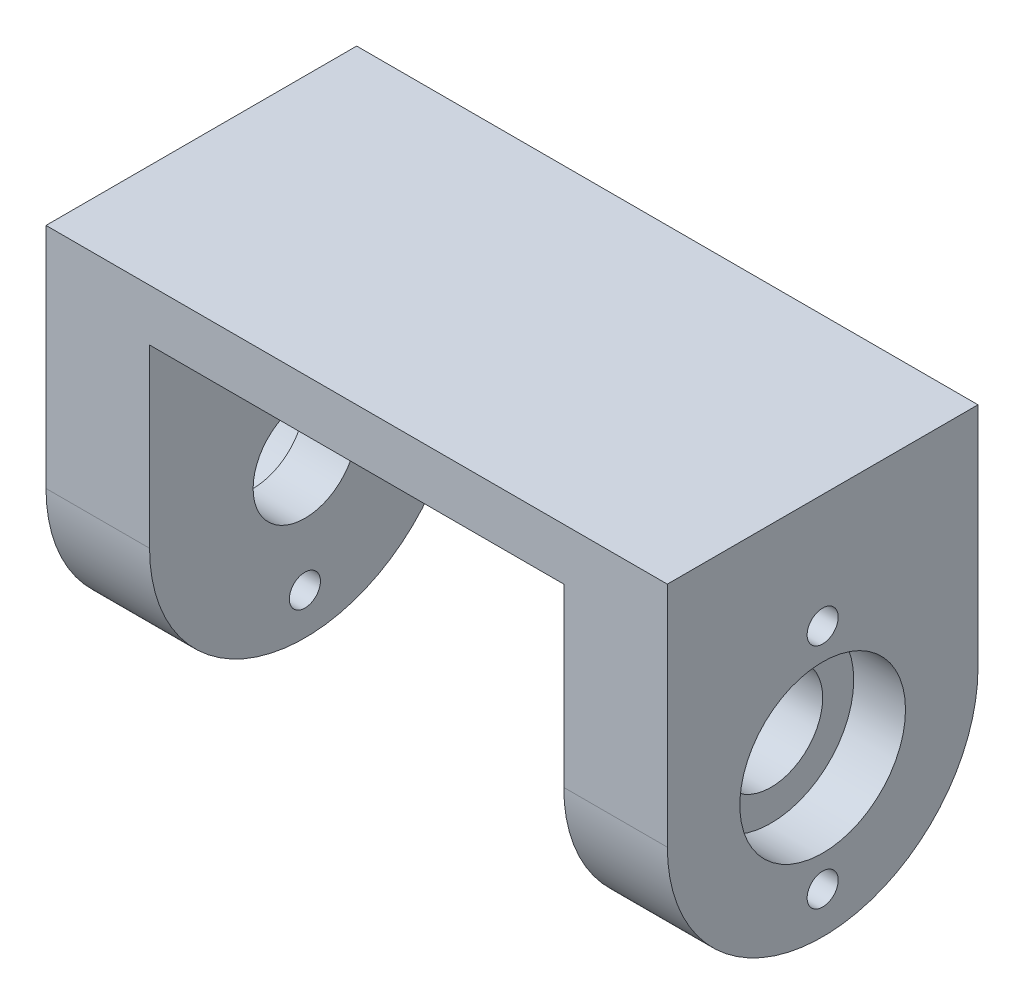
from build123d import *

# Parameters (mm, degrees)
SKETCH_1_R          = 15
SKETCH_1_R_2        = 5
EXTRUDE_1_DEPTH     = 60
SKETCH_3_W          = 40
SKETCH_3_H          = 60
CUT_EXTRUDE_1_DEPTH = 30
SKETCH_4_R          = 8
CUT_EXTRUDE_2_DEPTH = 5
CUT_EXTRUDE_START   = -5
SKETCH_5_R          = 8
CUT_EXTRUDE_3_DEPTH = 5
CUT_EXTRUDE_4_REACH = 67.643
SKETCH_6_R          = 1.5


with BuildPart() as part:
    # Sketch 1 → Extrude 1 (new body)
    # profile 1 of 2: a face of its own
    with BuildSketch(Plane(origin=(0, 0, 0), x_dir=(0, 0, -1), z_dir=(1, 0, 0))):
        with BuildLine():
            Line((-15, 22), (-15, 0))
            ThreePointArc((-15, 0), (0, 15), (15, 0))
            Line((15, 0), (15, 22))
            Line((15, 22), (-15, 22))
        make_face()
    # profile 2 of 2: a face of its own
    with BuildSketch(Plane(origin=(0, 0, 0), x_dir=(0, 0, -1), z_dir=(1, 0, 0))):
        Circle(SKETCH_1_R)
        Circle(SKETCH_1_R_2, mode=Mode.SUBTRACT)
    extrude(amount=EXTRUDE_1_DEPTH)

    # Sketch 3 → Cut-Extrude 1 (cut)
    with BuildSketch(Plane(origin=(0, 0, -15), x_dir=(-1, 0, 0), z_dir=(0, 0, -1))):
        with Locations((-30, -13)):
            Rectangle(SKETCH_3_W, SKETCH_3_H)
    extrude(amount=-CUT_EXTRUDE_1_DEPTH, mode=Mode.SUBTRACT)

    # Sketch 4 → Cut-Extrude 2 (cut)
    with BuildSketch(Plane.ZY):
        Circle(SKETCH_4_R)
    extrude(amount=-CUT_EXTRUDE_2_DEPTH, mode=Mode.SUBTRACT)

    # Sketch 5 → Cut-Extrude 3 (cut)
    with BuildSketch(Plane(origin=(60, 0, 0), x_dir=(0, 0, -1), z_dir=(1, 0, 0)).offset(CUT_EXTRUDE_START)):
        with Locations(Location((0, 0, 0), (0, 0, 180))):
            Circle(SKETCH_5_R)
    extrude(amount=CUT_EXTRUDE_3_DEPTH, mode=Mode.SUBTRACT)

    # Cut-Extrude 4: up to this face of the body (flat: up to its plane)
    cut_extrude_4_end = Plane(part.part.faces().sort_by_distance((0, 11, -14.523659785))[0])
    # Sketch 6 → Cut-Extrude 4 (cut, up to the picked face)
    with BuildSketch(Plane(origin=(60, 0, 0), x_dir=(0, 0, -1), z_dir=(1, 0, 0)), mode=Mode.PRIVATE) as cut_extrude_4_sk1:
        with Locations((0, -11)):
            Circle(SKETCH_6_R)
    cut_extrude_4_tool1 = split(extrude(cut_extrude_4_sk1.sketch, amount=-CUT_EXTRUDE_4_REACH, mode=Mode.PRIVATE), bisect_by=cut_extrude_4_end, keep=Keep.BOTH, mode=Mode.PRIVATE)
    # Sketch 6 → Cut-Extrude 4 (cut, up to the picked face)
    with BuildSketch(Plane(origin=(60, 0, 0), x_dir=(0, 0, -1), z_dir=(1, 0, 0)), mode=Mode.PRIVATE) as cut_extrude_4_sk2:
        with Locations((0, 11)):
            Circle(SKETCH_6_R)
    cut_extrude_4_tool2 = split(extrude(cut_extrude_4_sk2.sketch, amount=-CUT_EXTRUDE_4_REACH, mode=Mode.PRIVATE), bisect_by=cut_extrude_4_end, keep=Keep.BOTH, mode=Mode.PRIVATE)
    add(cut_extrude_4_tool1.solids().sort_by(Axis((60, -11, 0), (-1, 0, 0)))[0], mode=Mode.SUBTRACT)
    add(cut_extrude_4_tool2.solids().sort_by(Axis((60, 11, 0), (-1, 0, 0)))[0], mode=Mode.SUBTRACT)


solid = part.part
